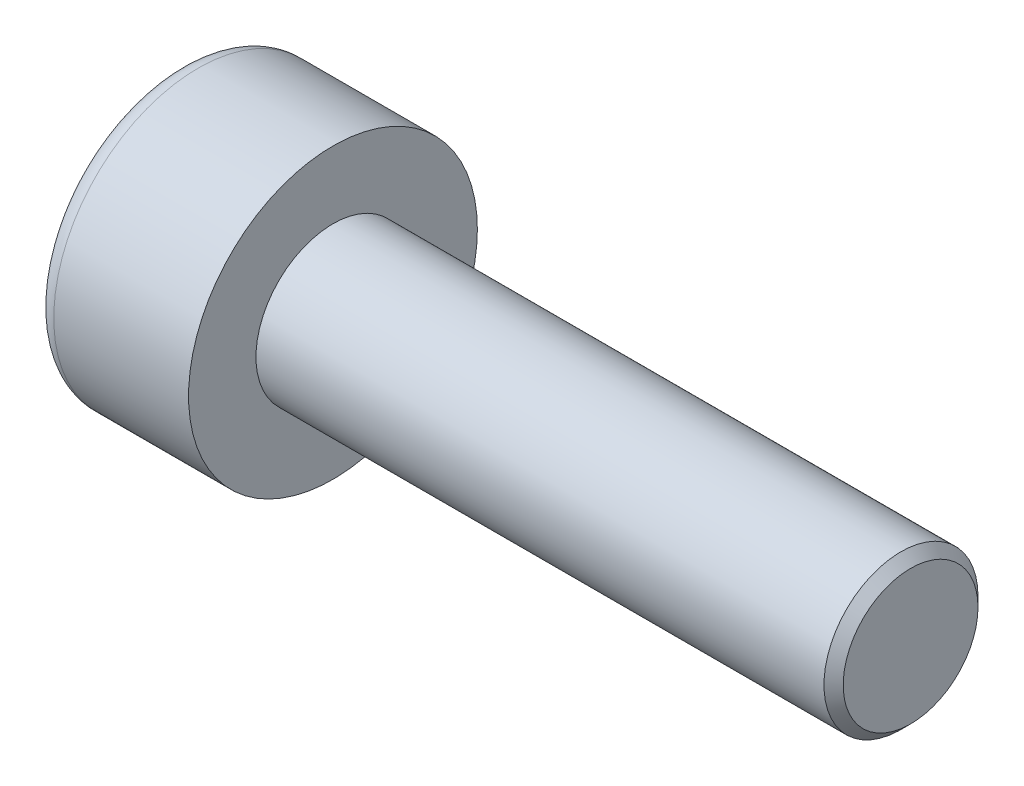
ISO-10303-21;
HEADER;
FILE_DESCRIPTION(('STEP AP214'),'2;1');
FILE_NAME('part.step','',(''),(''),'','','');
FILE_SCHEMA(('AUTOMOTIVE_DESIGN { 1 0 10303 214 1 1 1 1 }'));
ENDSEC;
DATA;
#1=APPLICATION_CONTEXT('core data for automotive mechanical design processes');
#2=APPLICATION_PROTOCOL_DEFINITION('international standard','automotive_design',2000,#1);
#3=PRODUCT_CONTEXT('',#1,'mechanical');
#4=PRODUCT('Part','Part','',(#3));
#5=PRODUCT_RELATED_PRODUCT_CATEGORY('part','',(#4));
#6=PRODUCT_DEFINITION_FORMATION('','',#4);
#7=PRODUCT_DEFINITION_CONTEXT('part definition',#1,'design');
#8=PRODUCT_DEFINITION('design','',#6,#7);
#9=PRODUCT_DEFINITION_SHAPE('','',#8);
#10=(LENGTH_UNIT() NAMED_UNIT(*) SI_UNIT(.MILLI.,.METRE.));
#11=(NAMED_UNIT(*) PLANE_ANGLE_UNIT() SI_UNIT($,.RADIAN.));
#12=(NAMED_UNIT(*) SI_UNIT($,.STERADIAN.) SOLID_ANGLE_UNIT());
#13=UNCERTAINTY_MEASURE_WITH_UNIT(LENGTH_MEASURE(1.E-05),#10,'distance_accuracy_value','');
#14=(GEOMETRIC_REPRESENTATION_CONTEXT(3) GLOBAL_UNCERTAINTY_ASSIGNED_CONTEXT((#13)) GLOBAL_UNIT_ASSIGNED_CONTEXT((#10,
#11,#12)) REPRESENTATION_CONTEXT('',''));
#15=CARTESIAN_POINT('',(0.,0.,0.));
#16=DIRECTION('',(0.,0.,1.));
#17=DIRECTION('',(1.,0.,0.));
#18=AXIS2_PLACEMENT_3D('',#15,#16,#17);
#19=CARTESIAN_POINT('',(0.7,0.,-0.866025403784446));
#20=DIRECTION('',(1.,0.,0.));
#21=DIRECTION('',(0.,0.,-1.));
#22=AXIS2_PLACEMENT_3D('',#19,#20,#21);
#23=PLANE('',#22);
#24=CARTESIAN_POINT('',(0.7,0.,0.));
#25=DIRECTION('',(1.,0.,0.));
#26=DIRECTION('',(0.,0.,-1.));
#27=AXIS2_PLACEMENT_3D('',#24,#25,#26);
#28=CIRCLE('',#27,0.750000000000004);
#29=CARTESIAN_POINT('',(0.7,-0.375000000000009,-0.649519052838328));
#30=VERTEX_POINT('',#29);
#31=CARTESIAN_POINT('',(0.7,-0.750000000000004,0.));
#32=VERTEX_POINT('',#31);
#33=EDGE_CURVE('E160',#30,#32,#28,.F.);
#34=ORIENTED_EDGE('',*,*,#33,.F.);
#35=DIRECTION('',(0.,0.866025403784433,-0.50000000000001));
#36=VECTOR('',#35,1.);
#37=CARTESIAN_POINT('',(0.7,-0.75,-0.43301270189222));
#38=LINE('',#37,#36);
#39=CARTESIAN_POINT('',(0.7,-0.75,-0.43301270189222));
#40=VERTEX_POINT('',#39);
#41=EDGE_CURVE('E168',#40,#30,#38,.T.);
#42=ORIENTED_EDGE('',*,*,#41,.F.);
#43=DIRECTION('',(0.,0.,-1.));
#44=VECTOR('',#43,1.);
#45=CARTESIAN_POINT('',(0.7,-0.750000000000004,0.433012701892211));
#46=LINE('',#45,#44);
#47=EDGE_CURVE('E185',#32,#40,#46,.T.);
#48=ORIENTED_EDGE('',*,*,#47,.F.);
#49=EDGE_LOOP('',(#34,#42,#48));
#50=FACE_BOUND('',#49,.T.);
#51=ADVANCED_FACE('F37',(#50),#23,.F.);
#52=CARTESIAN_POINT('',(0.7,-0.375000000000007,0.64951905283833));
#53=VERTEX_POINT('',#52);
#54=EDGE_CURVE('E290',#32,#53,#28,.F.);
#55=ORIENTED_EDGE('',*,*,#54,.F.);
#56=CARTESIAN_POINT('',(0.7,-0.750000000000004,0.433012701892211));
#57=VERTEX_POINT('',#56);
#58=EDGE_CURVE('E186',#57,#32,#46,.T.);
#59=ORIENTED_EDGE('',*,*,#58,.F.);
#60=DIRECTION('',(0.,-0.866025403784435,-0.500000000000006));
#61=VECTOR('',#60,1.);
#62=CARTESIAN_POINT('',(0.7,0.,0.866025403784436));
#63=LINE('',#62,#61);
#64=EDGE_CURVE('E181',#53,#57,#63,.T.);
#65=ORIENTED_EDGE('',*,*,#64,.F.);
#66=EDGE_LOOP('',(#55,#59,#65));
#67=FACE_BOUND('',#66,.T.);
#68=ADVANCED_FACE('F126',(#67),#23,.F.);
#69=CARTESIAN_POINT('',(0.7,0.374999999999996,0.649519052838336));
#70=VERTEX_POINT('',#69);
#71=EDGE_CURVE('E286',#53,#70,#28,.F.);
#72=ORIENTED_EDGE('',*,*,#71,.F.);
#73=CARTESIAN_POINT('',(0.7,0.,0.866025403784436));
#74=VERTEX_POINT('',#73);
#75=EDGE_CURVE('E182',#74,#53,#63,.T.);
#76=ORIENTED_EDGE('',*,*,#75,.F.);
#77=DIRECTION('',(0.,-0.866025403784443,0.499999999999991));
#78=VECTOR('',#77,1.);
#79=CARTESIAN_POINT('',(0.7,0.749999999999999,0.433012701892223));
#80=LINE('',#79,#78);
#81=EDGE_CURVE('E177',#70,#74,#80,.T.);
#82=ORIENTED_EDGE('',*,*,#81,.F.);
#83=EDGE_LOOP('',(#72,#76,#82));
#84=FACE_BOUND('',#83,.T.);
#85=ADVANCED_FACE('F132',(#84),#23,.F.);
#86=CARTESIAN_POINT('',(0.7,0.750000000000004,0.));
#87=VERTEX_POINT('',#86);
#88=EDGE_CURVE('E157',#70,#87,#28,.F.);
#89=ORIENTED_EDGE('',*,*,#88,.F.);
#90=CARTESIAN_POINT('',(0.7,0.749999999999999,0.433012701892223));
#91=VERTEX_POINT('',#90);
#92=EDGE_CURVE('E178',#91,#70,#80,.T.);
#93=ORIENTED_EDGE('',*,*,#92,.F.);
#94=DIRECTION('',(0.,0.,1.));
#95=VECTOR('',#94,1.);
#96=CARTESIAN_POINT('',(0.7,0.750000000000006,-0.433012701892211));
#97=LINE('',#96,#95);
#98=EDGE_CURVE('E172',#87,#91,#97,.T.);
#99=ORIENTED_EDGE('',*,*,#98,.F.);
#100=EDGE_LOOP('',(#89,#93,#99));
#101=FACE_BOUND('',#100,.T.);
#102=ADVANCED_FACE('F146',(#101),#23,.F.);
#103=CARTESIAN_POINT('',(0.7,0.,0.));
#104=DIRECTION('',(1.,0.,0.));
#105=DIRECTION('',(0.,0.,-1.));
#106=AXIS2_PLACEMENT_3D('',#103,#104,#105);
#107=CIRCLE('',#106,0.750000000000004);
#108=CARTESIAN_POINT('',(0.7,0.375000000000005,-0.649519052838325));
#109=VERTEX_POINT('',#108);
#110=EDGE_CURVE('E52',#109,#87,#107,.T.);
#111=ORIENTED_EDGE('',*,*,#110,.T.);
#112=CARTESIAN_POINT('',(0.7,0.750000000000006,-0.433012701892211));
#113=VERTEX_POINT('',#112);
#114=EDGE_CURVE('E165',#113,#87,#97,.T.);
#115=ORIENTED_EDGE('',*,*,#114,.F.);
#116=DIRECTION('',(0.,0.866025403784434,0.500000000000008));
#117=VECTOR('',#116,1.);
#118=CARTESIAN_POINT('',(0.7,0.,-0.866025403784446));
#119=LINE('',#118,#117);
#120=EDGE_CURVE('E162',#109,#113,#119,.T.);
#121=ORIENTED_EDGE('',*,*,#120,.F.);
#122=EDGE_LOOP('',(#111,#115,#121));
#123=FACE_BOUND('',#122,.T.);
#124=ADVANCED_FACE('F137',(#123),#23,.F.);
#125=EDGE_CURVE('E150',#109,#30,#28,.F.);
#126=ORIENTED_EDGE('',*,*,#125,.F.);
#127=CARTESIAN_POINT('',(0.7,0.,-0.866025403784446));
#128=VERTEX_POINT('',#127);
#129=EDGE_CURVE('E153',#128,#109,#119,.T.);
#130=ORIENTED_EDGE('',*,*,#129,.F.);
#131=EDGE_CURVE('E155',#30,#128,#38,.T.);
#132=ORIENTED_EDGE('',*,*,#131,.F.);
#133=EDGE_LOOP('',(#126,#130,#132));
#134=FACE_BOUND('',#133,.T.);
#135=ADVANCED_FACE('F128',(#134),#23,.F.);
#136=CARTESIAN_POINT('',(0.,0.,0.));
#137=DIRECTION('',(1.,0.,0.));
#138=DIRECTION('',(0.,0.,-1.));
#139=AXIS2_PLACEMENT_3D('',#136,#137,#138);
#140=PLANE('',#139);
#141=CARTESIAN_POINT('',(0.,0.,0.));
#142=DIRECTION('',(1.,0.,0.));
#143=DIRECTION('',(0.,0.,-1.));
#144=AXIS2_PLACEMENT_3D('',#141,#142,#143);
#145=CIRCLE('',#144,1.3);
#146=CARTESIAN_POINT('',(0.,0.,-1.3));
#147=VERTEX_POINT('',#146);
#148=EDGE_CURVE('E225',#147,#147,#145,.F.);
#149=ORIENTED_EDGE('',*,*,#148,.T.);
#150=EDGE_LOOP('',(#149));
#151=FACE_BOUND('',#150,.T.);
#152=DIRECTION('',(0.,0.866025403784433,-0.50000000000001));
#153=VECTOR('',#152,1.);
#154=CARTESIAN_POINT('',(0.,-0.75,-0.43301270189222));
#155=LINE('',#154,#153);
#156=CARTESIAN_POINT('',(0.,-0.75,-0.43301270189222));
#157=VERTEX_POINT('',#156);
#158=CARTESIAN_POINT('',(0.,0.,-0.866025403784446));
#159=VERTEX_POINT('',#158);
#160=EDGE_CURVE('E60',#157,#159,#155,.T.);
#161=ORIENTED_EDGE('',*,*,#160,.T.);
#162=DIRECTION('',(0.,0.866025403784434,0.500000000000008));
#163=VECTOR('',#162,1.);
#164=CARTESIAN_POINT('',(0.,0.,-0.866025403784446));
#165=LINE('',#164,#163);
#166=CARTESIAN_POINT('',(0.,0.750000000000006,-0.433012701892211));
#167=VERTEX_POINT('',#166);
#168=EDGE_CURVE('E191',#159,#167,#165,.T.);
#169=ORIENTED_EDGE('',*,*,#168,.T.);
#170=DIRECTION('',(0.,0.,1.));
#171=VECTOR('',#170,1.);
#172=CARTESIAN_POINT('',(0.,0.750000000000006,-0.433012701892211));
#173=LINE('',#172,#171);
#174=CARTESIAN_POINT('',(0.,0.749999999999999,0.433012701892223));
#175=VERTEX_POINT('',#174);
#176=EDGE_CURVE('E194',#167,#175,#173,.T.);
#177=ORIENTED_EDGE('',*,*,#176,.T.);
#178=DIRECTION('',(0.,-0.866025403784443,0.499999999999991));
#179=VECTOR('',#178,1.);
#180=CARTESIAN_POINT('',(0.,0.749999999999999,0.433012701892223));
#181=LINE('',#180,#179);
#182=CARTESIAN_POINT('',(0.,0.,0.866025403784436));
#183=VERTEX_POINT('',#182);
#184=EDGE_CURVE('E197',#175,#183,#181,.T.);
#185=ORIENTED_EDGE('',*,*,#184,.T.);
#186=DIRECTION('',(0.,-0.866025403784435,-0.500000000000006));
#187=VECTOR('',#186,1.);
#188=CARTESIAN_POINT('',(0.,0.,0.866025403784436));
#189=LINE('',#188,#187);
#190=CARTESIAN_POINT('',(0.,-0.750000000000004,0.433012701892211));
#191=VERTEX_POINT('',#190);
#192=EDGE_CURVE('E200',#183,#191,#189,.T.);
#193=ORIENTED_EDGE('',*,*,#192,.T.);
#194=DIRECTION('',(0.,0.,-1.));
#195=VECTOR('',#194,1.);
#196=CARTESIAN_POINT('',(0.,-0.750000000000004,0.433012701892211));
#197=LINE('',#196,#195);
#198=EDGE_CURVE('E203',#191,#157,#197,.T.);
#199=ORIENTED_EDGE('',*,*,#198,.T.);
#200=EDGE_LOOP('',(#161,#169,#177,#185,#193,#199));
#201=FACE_BOUND('',#200,.T.);
#202=ADVANCED_FACE('F136',(#151,#201),#140,.F.);
#203=CARTESIAN_POINT('',(1.6,0.,0.));
#204=DIRECTION('',(1.,0.,0.));
#205=DIRECTION('',(0.,0.,-1.));
#206=AXIS2_PLACEMENT_3D('',#203,#204,#205);
#207=PLANE('',#206);
#208=CARTESIAN_POINT('',(1.6,0.,0.));
#209=DIRECTION('',(1.,0.,0.));
#210=DIRECTION('',(0.,0.,-1.));
#211=AXIS2_PLACEMENT_3D('',#208,#209,#210);
#212=CIRCLE('',#211,1.5);
#213=CARTESIAN_POINT('',(1.6,0.,-1.5));
#214=VERTEX_POINT('',#213);
#215=EDGE_CURVE('E158',#214,#214,#212,.T.);
#216=ORIENTED_EDGE('',*,*,#215,.T.);
#217=EDGE_LOOP('',(#216));
#218=FACE_BOUND('',#217,.T.);
#219=CARTESIAN_POINT('',(1.6,0.,0.));
#220=DIRECTION('',(1.,0.,0.));
#221=DIRECTION('',(0.,0.,-1.));
#222=AXIS2_PLACEMENT_3D('',#219,#220,#221);
#223=CIRCLE('',#222,0.8);
#224=CARTESIAN_POINT('',(1.6,0.,-0.8));
#225=VERTEX_POINT('',#224);
#226=EDGE_CURVE('E216',#225,#225,#223,.T.);
#227=ORIENTED_EDGE('',*,*,#226,.F.);
#228=EDGE_LOOP('',(#227));
#229=FACE_BOUND('',#228,.T.);
#230=ADVANCED_FACE('F143',(#218,#229),#207,.T.);
#231=CARTESIAN_POINT('',(1.6,0.,0.));
#232=DIRECTION('',(-1.,0.,0.));
#233=DIRECTION('',(0.,0.,1.));
#234=AXIS2_PLACEMENT_3D('',#231,#232,#233);
#235=CYLINDRICAL_SURFACE('',#234,1.5);
#236=CARTESIAN_POINT('',(0.2,0.,0.));
#237=DIRECTION('',(1.,0.,0.));
#238=DIRECTION('',(0.,0.,-1.));
#239=AXIS2_PLACEMENT_3D('',#236,#237,#238);
#240=CIRCLE('',#239,1.5);
#241=CARTESIAN_POINT('',(0.2,0.,-1.5));
#242=VERTEX_POINT('',#241);
#243=EDGE_CURVE('E222',#242,#242,#240,.T.);
#244=ORIENTED_EDGE('',*,*,#243,.T.);
#245=EDGE_LOOP('',(#244));
#246=FACE_BOUND('',#245,.T.);
#247=ORIENTED_EDGE('',*,*,#215,.F.);
#248=EDGE_LOOP('',(#247));
#249=FACE_BOUND('',#248,.T.);
#250=ADVANCED_FACE('F241',(#246,#249),#235,.T.);
#251=CARTESIAN_POINT('',(7.6,0.,0.));
#252=DIRECTION('',(-1.,0.,0.));
#253=DIRECTION('',(0.,0.,1.));
#254=AXIS2_PLACEMENT_3D('',#251,#252,#253);
#255=CYLINDRICAL_SURFACE('',#254,0.8);
#256=CARTESIAN_POINT('',(7.5,0.,0.));
#257=DIRECTION('',(1.,0.,0.));
#258=DIRECTION('',(0.,0.,-1.));
#259=AXIS2_PLACEMENT_3D('',#256,#257,#258);
#260=CIRCLE('',#259,0.8);
#261=CARTESIAN_POINT('',(7.5,0.,-0.8));
#262=VERTEX_POINT('',#261);
#263=EDGE_CURVE('E11',#262,#262,#260,.F.);
#264=ORIENTED_EDGE('',*,*,#263,.T.);
#265=EDGE_LOOP('',(#264));
#266=FACE_BOUND('',#265,.T.);
#267=ORIENTED_EDGE('',*,*,#226,.T.);
#268=EDGE_LOOP('',(#267));
#269=FACE_BOUND('',#268,.T.);
#270=ADVANCED_FACE('F238',(#266,#269),#255,.T.);
#271=CARTESIAN_POINT('',(7.6,0.,0.));
#272=DIRECTION('',(1.,0.,0.));
#273=DIRECTION('',(0.,0.,-1.));
#274=AXIS2_PLACEMENT_3D('',#271,#272,#273);
#275=PLANE('',#274);
#276=CARTESIAN_POINT('',(7.6,0.,0.));
#277=DIRECTION('',(1.,0.,0.));
#278=DIRECTION('',(0.,0.,-1.));
#279=AXIS2_PLACEMENT_3D('',#276,#277,#278);
#280=CIRCLE('',#279,0.699999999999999);
#281=CARTESIAN_POINT('',(7.6,0.,-0.699999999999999));
#282=VERTEX_POINT('',#281);
#283=EDGE_CURVE('E45',#282,#282,#280,.T.);
#284=ORIENTED_EDGE('',*,*,#283,.T.);
#285=EDGE_LOOP('',(#284));
#286=FACE_BOUND('',#285,.T.);
#287=ADVANCED_FACE('F230',(#286),#275,.T.);
#288=CARTESIAN_POINT('',(0.7,-0.75,-0.43301270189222));
#289=DIRECTION('',(0.,0.50000000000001,0.866025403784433));
#290=DIRECTION('',(0.,-0.866025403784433,0.50000000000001));
#291=AXIS2_PLACEMENT_3D('',#288,#289,#290);
#292=PLANE('',#291);
#293=ORIENTED_EDGE('',*,*,#160,.F.);
#294=DIRECTION('',(-1.,0.,0.));
#295=VECTOR('',#294,1.);
#296=CARTESIAN_POINT('',(0.7,-0.75,-0.43301270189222));
#297=LINE('',#296,#295);
#298=EDGE_CURVE('E189',#40,#157,#297,.T.);
#299=ORIENTED_EDGE('',*,*,#298,.F.);
#300=ORIENTED_EDGE('',*,*,#41,.T.);
#301=ORIENTED_EDGE('',*,*,#131,.T.);
#302=DIRECTION('',(-1.,0.,0.));
#303=VECTOR('',#302,1.);
#304=CARTESIAN_POINT('',(0.7,0.,-0.866025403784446));
#305=LINE('',#304,#303);
#306=EDGE_CURVE('E171',#128,#159,#305,.T.);
#307=ORIENTED_EDGE('',*,*,#306,.T.);
#308=EDGE_LOOP('',(#293,#299,#300,#301,#307));
#309=FACE_BOUND('',#308,.T.);
#310=ADVANCED_FACE('F256',(#309),#292,.T.);
#311=CARTESIAN_POINT('',(0.7,0.,-0.866025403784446));
#312=DIRECTION('',(0.,-0.500000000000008,0.866025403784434));
#313=DIRECTION('',(0.,-0.866025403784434,-0.500000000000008));
#314=AXIS2_PLACEMENT_3D('',#311,#312,#313);
#315=PLANE('',#314);
#316=ORIENTED_EDGE('',*,*,#168,.F.);
#317=ORIENTED_EDGE('',*,*,#306,.F.);
#318=ORIENTED_EDGE('',*,*,#129,.T.);
#319=ORIENTED_EDGE('',*,*,#120,.T.);
#320=DIRECTION('',(-1.,0.,0.));
#321=VECTOR('',#320,1.);
#322=CARTESIAN_POINT('',(0.7,0.750000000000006,-0.433012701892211));
#323=LINE('',#322,#321);
#324=EDGE_CURVE('E213',#113,#167,#323,.T.);
#325=ORIENTED_EDGE('',*,*,#324,.T.);
#326=EDGE_LOOP('',(#316,#317,#318,#319,#325));
#327=FACE_BOUND('',#326,.T.);
#328=ADVANCED_FACE('F170',(#327),#315,.T.);
#329=CARTESIAN_POINT('',(0.7,0.750000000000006,-0.433012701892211));
#330=DIRECTION('',(0.,-1.,0.));
#331=DIRECTION('',(0.,0.,-1.));
#332=AXIS2_PLACEMENT_3D('',#329,#330,#331);
#333=PLANE('',#332);
#334=ORIENTED_EDGE('',*,*,#176,.F.);
#335=ORIENTED_EDGE('',*,*,#324,.F.);
#336=ORIENTED_EDGE('',*,*,#114,.T.);
#337=ORIENTED_EDGE('',*,*,#98,.T.);
#338=DIRECTION('',(-1.,0.,0.));
#339=VECTOR('',#338,1.);
#340=CARTESIAN_POINT('',(0.7,0.749999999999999,0.433012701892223));
#341=LINE('',#340,#339);
#342=EDGE_CURVE('E211',#91,#175,#341,.T.);
#343=ORIENTED_EDGE('',*,*,#342,.T.);
#344=EDGE_LOOP('',(#334,#335,#336,#337,#343));
#345=FACE_BOUND('',#344,.T.);
#346=ADVANCED_FACE('F261',(#345),#333,.T.);
#347=CARTESIAN_POINT('',(0.7,0.749999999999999,0.433012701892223));
#348=DIRECTION('',(0.,-0.499999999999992,-0.866025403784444));
#349=DIRECTION('',(0.,0.866025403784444,-0.499999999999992));
#350=AXIS2_PLACEMENT_3D('',#347,#348,#349);
#351=PLANE('',#350);
#352=ORIENTED_EDGE('',*,*,#184,.F.);
#353=ORIENTED_EDGE('',*,*,#342,.F.);
#354=ORIENTED_EDGE('',*,*,#92,.T.);
#355=ORIENTED_EDGE('',*,*,#81,.T.);
#356=DIRECTION('',(-1.,0.,0.));
#357=VECTOR('',#356,1.);
#358=CARTESIAN_POINT('',(0.7,0.,0.866025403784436));
#359=LINE('',#358,#357);
#360=EDGE_CURVE('E209',#74,#183,#359,.T.);
#361=ORIENTED_EDGE('',*,*,#360,.T.);
#362=EDGE_LOOP('',(#352,#353,#354,#355,#361));
#363=FACE_BOUND('',#362,.T.);
#364=ADVANCED_FACE('F264',(#363),#351,.T.);
#365=CARTESIAN_POINT('',(0.7,0.,0.866025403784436));
#366=DIRECTION('',(0.,0.500000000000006,-0.866025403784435));
#367=DIRECTION('',(0.,0.866025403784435,0.500000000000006));
#368=AXIS2_PLACEMENT_3D('',#365,#366,#367);
#369=PLANE('',#368);
#370=ORIENTED_EDGE('',*,*,#192,.F.);
#371=ORIENTED_EDGE('',*,*,#360,.F.);
#372=ORIENTED_EDGE('',*,*,#75,.T.);
#373=ORIENTED_EDGE('',*,*,#64,.T.);
#374=DIRECTION('',(-1.,0.,0.));
#375=VECTOR('',#374,1.);
#376=CARTESIAN_POINT('',(0.7,-0.750000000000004,0.433012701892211));
#377=LINE('',#376,#375);
#378=EDGE_CURVE('E207',#57,#191,#377,.T.);
#379=ORIENTED_EDGE('',*,*,#378,.T.);
#380=EDGE_LOOP('',(#370,#371,#372,#373,#379));
#381=FACE_BOUND('',#380,.T.);
#382=ADVANCED_FACE('F121',(#381),#369,.T.);
#383=CARTESIAN_POINT('',(0.7,-0.750000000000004,0.433012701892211));
#384=DIRECTION('',(0.,1.,0.));
#385=DIRECTION('',(0.,0.,1.));
#386=AXIS2_PLACEMENT_3D('',#383,#384,#385);
#387=PLANE('',#386);
#388=ORIENTED_EDGE('',*,*,#198,.F.);
#389=ORIENTED_EDGE('',*,*,#378,.F.);
#390=ORIENTED_EDGE('',*,*,#58,.T.);
#391=ORIENTED_EDGE('',*,*,#47,.T.);
#392=ORIENTED_EDGE('',*,*,#298,.T.);
#393=EDGE_LOOP('',(#388,#389,#390,#391,#392));
#394=FACE_BOUND('',#393,.T.);
#395=ADVANCED_FACE('F114',(#394),#387,.T.);
#396=CARTESIAN_POINT('',(0.7,0.,0.));
#397=DIRECTION('',(-1.,0.,0.));
#398=DIRECTION('',(0.,0.,1.));
#399=AXIS2_PLACEMENT_3D('',#396,#397,#398);
#400=CONICAL_SURFACE('',#399,0.750000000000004,1.04719755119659);
#401=CARTESIAN_POINT('',(1.13301270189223,0.,0.));
#402=VERTEX_POINT('',#401);
#403=VERTEX_LOOP('',#402);
#404=FACE_BOUND('',#403,.T.);
#405=ORIENTED_EDGE('',*,*,#110,.F.);
#406=ORIENTED_EDGE('',*,*,#125,.T.);
#407=ORIENTED_EDGE('',*,*,#33,.T.);
#408=ORIENTED_EDGE('',*,*,#54,.T.);
#409=ORIENTED_EDGE('',*,*,#71,.T.);
#410=ORIENTED_EDGE('',*,*,#88,.T.);
#411=EDGE_LOOP('',(#405,#406,#407,#408,#409,#410));
#412=FACE_BOUND('',#411,.T.);
#413=ADVANCED_FACE('F111',(#404,#412),#400,.F.);
#414=CARTESIAN_POINT('',(0.2,0.,0.));
#415=DIRECTION('',(1.,0.,0.));
#416=DIRECTION('',(0.,0.,-1.));
#417=AXIS2_PLACEMENT_3D('',#414,#415,#416);
#418=TOROIDAL_SURFACE('',#417,1.3,0.2);
#419=ORIENTED_EDGE('',*,*,#148,.F.);
#420=EDGE_LOOP('',(#419));
#421=FACE_BOUND('',#420,.T.);
#422=ORIENTED_EDGE('',*,*,#243,.F.);
#423=EDGE_LOOP('',(#422));
#424=FACE_BOUND('',#423,.T.);
#425=ADVANCED_FACE('F113',(#421,#424),#418,.T.);
#426=CARTESIAN_POINT('',(7.6,0.,0.));
#427=DIRECTION('',(-1.,0.,0.));
#428=DIRECTION('',(0.,0.,1.));
#429=AXIS2_PLACEMENT_3D('',#426,#427,#428);
#430=CONICAL_SURFACE('',#429,0.699999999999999,0.785398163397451);
#431=ORIENTED_EDGE('',*,*,#263,.F.);
#432=EDGE_LOOP('',(#431));
#433=FACE_BOUND('',#432,.T.);
#434=ORIENTED_EDGE('',*,*,#283,.F.);
#435=EDGE_LOOP('',(#434));
#436=FACE_BOUND('',#435,.T.);
#437=ADVANCED_FACE('F39',(#433,#436),#430,.T.);
#438=CLOSED_SHELL('',(#51,#68,#85,#102,#124,#135,#202,#230,#250,#270,#287,#310,#328,#346,#364,
#382,#395,#413,#425,#437));
#439=MANIFOLD_SOLID_BREP('B2',#438);
#440=ADVANCED_BREP_SHAPE_REPRESENTATION('',(#18,#439),#14);
#441=SHAPE_DEFINITION_REPRESENTATION(#9,#440);
ENDSEC;
END-ISO-10303-21;
